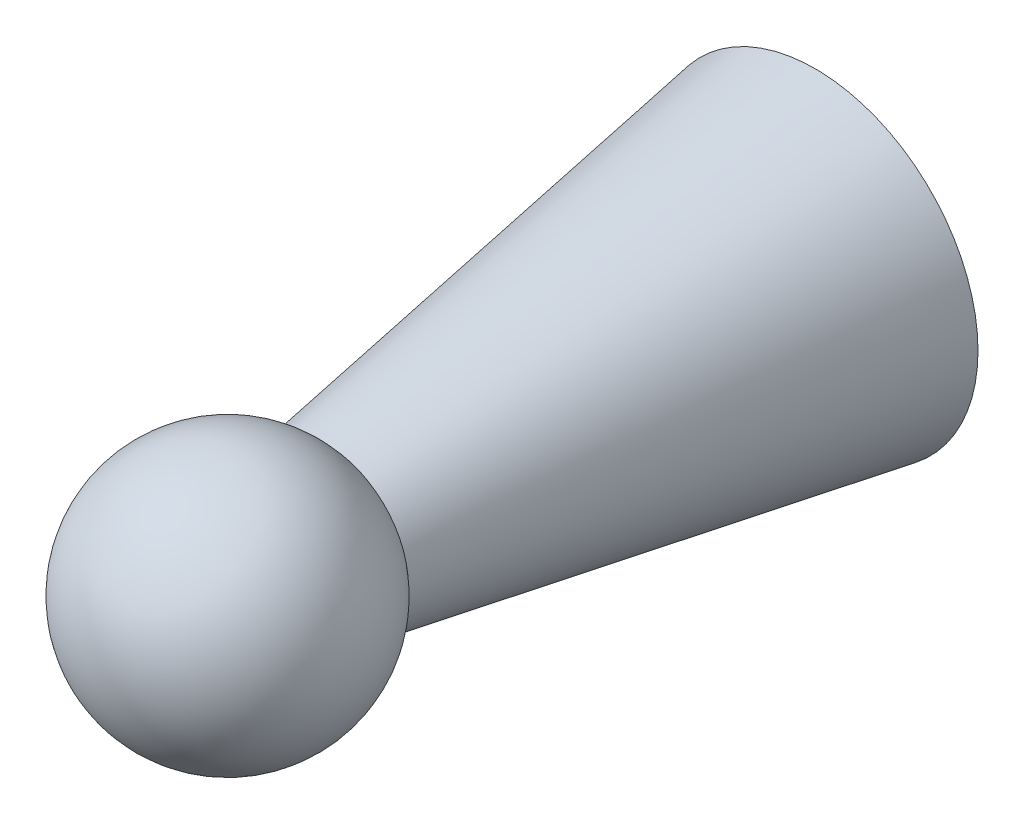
ISO-10303-21;
HEADER;
FILE_DESCRIPTION(('STEP AP214'),'2;1');
FILE_NAME('part.step','',(''),(''),'','','');
FILE_SCHEMA(('AUTOMOTIVE_DESIGN { 1 0 10303 214 1 1 1 1 }'));
ENDSEC;
DATA;
#1=APPLICATION_CONTEXT('core data for automotive mechanical design processes');
#2=APPLICATION_PROTOCOL_DEFINITION('international standard','automotive_design',2000,#1);
#3=PRODUCT_CONTEXT('',#1,'mechanical');
#4=PRODUCT('Part','Part','',(#3));
#5=PRODUCT_RELATED_PRODUCT_CATEGORY('part','',(#4));
#6=PRODUCT_DEFINITION_FORMATION('','',#4);
#7=PRODUCT_DEFINITION_CONTEXT('part definition',#1,'design');
#8=PRODUCT_DEFINITION('design','',#6,#7);
#9=PRODUCT_DEFINITION_SHAPE('','',#8);
#10=(LENGTH_UNIT() NAMED_UNIT(*) SI_UNIT(.MILLI.,.METRE.));
#11=(NAMED_UNIT(*) PLANE_ANGLE_UNIT() SI_UNIT($,.RADIAN.));
#12=(NAMED_UNIT(*) SI_UNIT($,.STERADIAN.) SOLID_ANGLE_UNIT());
#13=UNCERTAINTY_MEASURE_WITH_UNIT(LENGTH_MEASURE(1.E-05),#10,'distance_accuracy_value','');
#14=(GEOMETRIC_REPRESENTATION_CONTEXT(3) GLOBAL_UNCERTAINTY_ASSIGNED_CONTEXT((#13)) GLOBAL_UNIT_ASSIGNED_CONTEXT((#10,
#11,#12)) REPRESENTATION_CONTEXT('',''));
#15=CARTESIAN_POINT('',(0.,0.,0.));
#16=DIRECTION('',(0.,0.,1.));
#17=DIRECTION('',(1.,0.,0.));
#18=AXIS2_PLACEMENT_3D('',#15,#16,#17);
#19=CARTESIAN_POINT('',(0.,0.,0.));
#20=DIRECTION('',(0.,0.,1.));
#21=DIRECTION('',(1.,0.,0.));
#22=AXIS2_PLACEMENT_3D('',#19,#20,#21);
#23=PLANE('',#22);
#24=CARTESIAN_POINT('',(0.,0.,0.));
#25=DIRECTION('',(0.,0.,-1.));
#26=DIRECTION('',(-1.,0.,0.));
#27=AXIS2_PLACEMENT_3D('',#24,#25,#26);
#28=CIRCLE('',#27,2.5);
#29=CARTESIAN_POINT('',(-2.5,0.,0.));
#30=VERTEX_POINT('',#29);
#31=EDGE_CURVE('E54',#30,#30,#28,.T.);
#32=ORIENTED_EDGE('',*,*,#31,.F.);
#33=EDGE_LOOP('',(#32));
#34=FACE_BOUND('',#33,.T.);
#35=CARTESIAN_POINT('',(0.,0.,0.));
#36=DIRECTION('',(0.,0.,1.));
#37=DIRECTION('',(1.,0.,0.));
#38=AXIS2_PLACEMENT_3D('',#35,#36,#37);
#39=CIRCLE('',#38,5.);
#40=CARTESIAN_POINT('',(5.,0.,0.));
#41=VERTEX_POINT('',#40);
#42=EDGE_CURVE('E43',#41,#41,#39,.T.);
#43=ORIENTED_EDGE('',*,*,#42,.F.);
#44=EDGE_LOOP('',(#43));
#45=FACE_BOUND('',#44,.T.);
#46=ADVANCED_FACE('F32',(#34,#45),#23,.F.);
#47=CARTESIAN_POINT('',(0.,0.,18.0535714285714));
#48=DIRECTION('',(0.,0.,1.));
#49=DIRECTION('',(1.,0.,0.));
#50=AXIS2_PLACEMENT_3D('',#47,#48,#49);
#51=SPHERICAL_SURFACE('',#50,3.94642857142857);
#52=CARTESIAN_POINT('',(2.5,0.,15.));
#53=CARTESIAN_POINT('',(2.50000086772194,0.0409061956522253,15.));
#54=CARTESIAN_POINT('',(2.49899604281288,0.0818123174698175,15.));
#55=CARTESIAN_POINT('',(2.49498123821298,0.163526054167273,15.));
#56=CARTESIAN_POINT('',(2.49197125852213,0.204333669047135,15.));
#57=CARTESIAN_POINT('',(2.48395237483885,0.285752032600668,15.));
#58=CARTESIAN_POINT('',(2.47894347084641,0.326362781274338,15.));
#59=CARTESIAN_POINT('',(2.46693907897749,0.407289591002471,15.));
#60=CARTESIAN_POINT('',(2.45994359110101,0.447605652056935,15.));
#61=CARTESIAN_POINT('',(2.44398281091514,0.527845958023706,15.));
#62=CARTESIAN_POINT('',(2.43501751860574,0.567770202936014,15.));
#63=CARTESIAN_POINT('',(2.41513874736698,0.647130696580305,15.));
#64=CARTESIAN_POINT('',(2.40422526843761,0.68656694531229,15.));
#65=CARTESIAN_POINT('',(2.38047641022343,0.764856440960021,15.));
#66=CARTESIAN_POINT('',(2.36764103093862,0.803709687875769,15.));
#67=CARTESIAN_POINT('',(2.34007929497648,0.880739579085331,15.));
#68=CARTESIAN_POINT('',(2.32535293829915,0.918916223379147,15.));
#69=CARTESIAN_POINT('',(2.29404472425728,0.994500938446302,15.));
#70=CARTESIAN_POINT('',(2.27746286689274,1.03190900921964,15.));
#71=CARTESIAN_POINT('',(2.24248359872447,1.10586645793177,15.));
#72=CARTESIAN_POINT('',(2.22408618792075,1.14241583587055,15.));
#73=CARTESIAN_POINT('',(2.18552013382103,1.21456784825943,15.));
#74=CARTESIAN_POINT('',(2.16535149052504,1.25017048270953,15.));
#75=CARTESIAN_POINT('',(2.12329155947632,1.32034323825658,15.));
#76=CARTESIAN_POINT('',(2.1014002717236,1.35491335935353,15.));
#77=CARTESIAN_POINT('',(2.05594778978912,1.42293780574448,15.));
#78=CARTESIAN_POINT('',(2.03238659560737,1.45639213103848,15.));
#79=CARTESIAN_POINT('',(1.98365106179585,1.52210439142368,15.));
#80=CARTESIAN_POINT('',(1.95847672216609,1.55436232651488,15.));
#81=CARTESIAN_POINT('',(1.90657554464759,1.61760409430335,15.));
#82=CARTESIAN_POINT('',(1.87984870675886,1.64858792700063,15.));
#83=CARTESIAN_POINT('',(1.82490692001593,1.70920684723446,15.));
#84=CARTESIAN_POINT('',(1.79669197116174,1.738841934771,15.));
#85=CARTESIAN_POINT('',(1.738841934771,1.79669197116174,15.));
#86=CARTESIAN_POINT('',(1.70920684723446,1.82490692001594,15.));
#87=CARTESIAN_POINT('',(1.64858792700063,1.87984870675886,15.));
#88=CARTESIAN_POINT('',(1.61760409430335,1.90657554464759,15.));
#89=CARTESIAN_POINT('',(1.55436232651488,1.9584767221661,15.));
#90=CARTESIAN_POINT('',(1.52210439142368,1.98365106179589,15.));
#91=CARTESIAN_POINT('',(1.45639213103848,2.03238659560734,15.));
#92=CARTESIAN_POINT('',(1.42293780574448,2.05594778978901,15.));
#93=CARTESIAN_POINT('',(1.35491335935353,2.10140027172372,15.));
#94=CARTESIAN_POINT('',(1.3203432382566,2.12329155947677,15.));
#95=CARTESIAN_POINT('',(1.25017048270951,2.16535149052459,15.));
#96=CARTESIAN_POINT('',(1.21456784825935,2.18552013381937,15.));
#97=CARTESIAN_POINT('',(1.14241583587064,2.2240861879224,15.));
#98=CARTESIAN_POINT('',(1.10586645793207,2.24248359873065,15.));
#99=CARTESIAN_POINT('',(1.03190900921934,2.27746286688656,15.));
#100=CARTESIAN_POINT('',(0.994500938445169,2.29404472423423,15.));
#101=CARTESIAN_POINT('',(0.918916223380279,2.32535293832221,15.));
#102=CARTESIAN_POINT('',(0.880739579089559,2.34007929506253,15.));
#103=CARTESIAN_POINT('',(0.803709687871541,2.36764103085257,15.));
#104=CARTESIAN_POINT('',(0.764856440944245,2.38047640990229,15.));
#105=CARTESIAN_POINT('',(0.686566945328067,2.40422526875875,15.));
#106=CARTESIAN_POINT('',(0.647130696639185,2.41513874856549,15.));
#107=CARTESIAN_POINT('',(0.567770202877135,2.43501751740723,15.));
#108=CARTESIAN_POINT('',(0.527845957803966,2.44398280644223,15.));
#109=CARTESIAN_POINT('',(0.447605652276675,2.45994359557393,15.));
#110=CARTESIAN_POINT('',(0.407289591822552,2.46693909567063,15.));
#111=CARTESIAN_POINT('',(0.326362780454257,2.47894345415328,15.));
#112=CARTESIAN_POINT('',(0.285752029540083,2.48395231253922,15.));
#113=CARTESIAN_POINT('',(0.20433367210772,2.49197132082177,15.));
#114=CARTESIAN_POINT('',(0.16352606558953,2.49498147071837,15.));
#115=CARTESIAN_POINT('',(0.0818123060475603,2.49899581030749,15.));
#116=CARTESIAN_POINT('',(0.0409061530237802,2.5,15.));
#117=CARTESIAN_POINT('',(-0.0409061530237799,2.5,15.));
#118=CARTESIAN_POINT('',(-0.08181230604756,2.49899581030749,15.));
#119=CARTESIAN_POINT('',(-0.16352606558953,2.49498147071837,15.));
#120=CARTESIAN_POINT('',(-0.20433367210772,2.49197132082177,15.));
#121=CARTESIAN_POINT('',(-0.285752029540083,2.48395231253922,15.));
#122=CARTESIAN_POINT('',(-0.326362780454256,2.47894345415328,15.));
#123=CARTESIAN_POINT('',(-0.407289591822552,2.46693909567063,15.));
#124=CARTESIAN_POINT('',(-0.447605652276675,2.45994359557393,15.));
#125=CARTESIAN_POINT('',(-0.527845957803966,2.44398280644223,15.));
#126=CARTESIAN_POINT('',(-0.567770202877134,2.43501751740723,15.));
#127=CARTESIAN_POINT('',(-0.647130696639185,2.41513874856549,15.));
#128=CARTESIAN_POINT('',(-0.686566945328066,2.40422526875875,15.));
#129=CARTESIAN_POINT('',(-0.764856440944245,2.38047640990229,15.));
#130=CARTESIAN_POINT('',(-0.803709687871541,2.36764103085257,15.));
#131=CARTESIAN_POINT('',(-0.880739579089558,2.34007929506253,15.));
#132=CARTESIAN_POINT('',(-0.918916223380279,2.32535293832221,15.));
#133=CARTESIAN_POINT('',(-0.994500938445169,2.29404472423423,15.));
#134=CARTESIAN_POINT('',(-1.03190900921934,2.27746286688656,15.));
#135=CARTESIAN_POINT('',(-1.10586645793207,2.24248359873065,15.));
#136=CARTESIAN_POINT('',(-1.14241583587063,2.2240861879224,15.));
#137=CARTESIAN_POINT('',(-1.21456784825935,2.18552013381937,15.));
#138=CARTESIAN_POINT('',(-1.25017048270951,2.16535149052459,15.));
#139=CARTESIAN_POINT('',(-1.3203432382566,2.12329155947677,15.));
#140=CARTESIAN_POINT('',(-1.35491335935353,2.10140027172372,15.));
#141=CARTESIAN_POINT('',(-1.42293780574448,2.05594778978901,15.));
#142=CARTESIAN_POINT('',(-1.45639213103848,2.03238659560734,15.));
#143=CARTESIAN_POINT('',(-1.52210439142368,1.98365106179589,15.));
#144=CARTESIAN_POINT('',(-1.55436232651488,1.9584767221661,15.));
#145=CARTESIAN_POINT('',(-1.61760409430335,1.90657554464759,15.));
#146=CARTESIAN_POINT('',(-1.64858792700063,1.87984870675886,15.));
#147=CARTESIAN_POINT('',(-1.70920684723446,1.82490692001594,15.));
#148=CARTESIAN_POINT('',(-1.738841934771,1.79669197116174,15.));
#149=CARTESIAN_POINT('',(-1.79669197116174,1.738841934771,15.));
#150=CARTESIAN_POINT('',(-1.82490692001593,1.70920684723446,15.));
#151=CARTESIAN_POINT('',(-1.87984870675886,1.64858792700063,15.));
#152=CARTESIAN_POINT('',(-1.90657554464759,1.61760409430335,15.));
#153=CARTESIAN_POINT('',(-1.9584767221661,1.55436232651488,15.));
#154=CARTESIAN_POINT('',(-1.98365106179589,1.52210439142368,15.));
#155=CARTESIAN_POINT('',(-2.03238659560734,1.45639213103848,15.));
#156=CARTESIAN_POINT('',(-2.05594778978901,1.42293780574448,15.));
#157=CARTESIAN_POINT('',(-2.10140027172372,1.35491335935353,15.));
#158=CARTESIAN_POINT('',(-2.12329155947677,1.3203432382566,15.));
#159=CARTESIAN_POINT('',(-2.16535149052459,1.25017048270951,15.));
#160=CARTESIAN_POINT('',(-2.18552013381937,1.21456784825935,15.));
#161=CARTESIAN_POINT('',(-2.2240861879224,1.14241583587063,15.));
#162=CARTESIAN_POINT('',(-2.24248359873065,1.10586645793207,15.));
#163=CARTESIAN_POINT('',(-2.27746286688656,1.03190900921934,15.));
#164=CARTESIAN_POINT('',(-2.29404472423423,0.994500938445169,15.));
#165=CARTESIAN_POINT('',(-2.32535293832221,0.91891622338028,15.));
#166=CARTESIAN_POINT('',(-2.34007929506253,0.880739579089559,15.));
#167=CARTESIAN_POINT('',(-2.36764103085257,0.803709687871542,15.));
#168=CARTESIAN_POINT('',(-2.38047640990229,0.764856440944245,15.));
#169=CARTESIAN_POINT('',(-2.40422526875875,0.686566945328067,15.));
#170=CARTESIAN_POINT('',(-2.41513874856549,0.647130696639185,15.));
#171=CARTESIAN_POINT('',(-2.43501751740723,0.567770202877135,15.));
#172=CARTESIAN_POINT('',(-2.44398280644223,0.527845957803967,15.));
#173=CARTESIAN_POINT('',(-2.45994359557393,0.447605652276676,15.));
#174=CARTESIAN_POINT('',(-2.46693909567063,0.407289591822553,15.));
#175=CARTESIAN_POINT('',(-2.47894345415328,0.326362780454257,15.));
#176=CARTESIAN_POINT('',(-2.48395231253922,0.285752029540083,15.));
#177=CARTESIAN_POINT('',(-2.49197132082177,0.20433367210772,15.));
#178=CARTESIAN_POINT('',(-2.49498147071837,0.16352606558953,15.));
#179=CARTESIAN_POINT('',(-2.49899581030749,0.0818123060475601,15.));
#180=CARTESIAN_POINT('',(-2.5,0.0409061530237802,15.));
#181=CARTESIAN_POINT('',(-2.5,-0.0409061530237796,15.));
#182=CARTESIAN_POINT('',(-2.49899581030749,-0.0818123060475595,15.));
#183=CARTESIAN_POINT('',(-2.49498147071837,-0.163526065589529,15.));
#184=CARTESIAN_POINT('',(-2.49197132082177,-0.20433367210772,15.));
#185=CARTESIAN_POINT('',(-2.48395231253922,-0.285752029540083,15.));
#186=CARTESIAN_POINT('',(-2.47894345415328,-0.326362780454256,15.));
#187=CARTESIAN_POINT('',(-2.46693909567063,-0.407289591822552,15.));
#188=CARTESIAN_POINT('',(-2.45994359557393,-0.447605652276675,15.));
#189=CARTESIAN_POINT('',(-2.44398280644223,-0.527845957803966,15.));
#190=CARTESIAN_POINT('',(-2.43501751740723,-0.567770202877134,15.));
#191=CARTESIAN_POINT('',(-2.41513874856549,-0.647130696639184,15.));
#192=CARTESIAN_POINT('',(-2.40422526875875,-0.686566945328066,15.));
#193=CARTESIAN_POINT('',(-2.38047640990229,-0.764856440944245,15.));
#194=CARTESIAN_POINT('',(-2.36764103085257,-0.803709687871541,15.));
#195=CARTESIAN_POINT('',(-2.34007929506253,-0.880739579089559,15.));
#196=CARTESIAN_POINT('',(-2.32535293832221,-0.918916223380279,15.));
#197=CARTESIAN_POINT('',(-2.29404472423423,-0.994500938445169,15.));
#198=CARTESIAN_POINT('',(-2.27746286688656,-1.03190900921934,15.));
#199=CARTESIAN_POINT('',(-2.24248359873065,-1.10586645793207,15.));
#200=CARTESIAN_POINT('',(-2.2240861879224,-1.14241583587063,15.));
#201=CARTESIAN_POINT('',(-2.18552013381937,-1.21456784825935,15.));
#202=CARTESIAN_POINT('',(-2.16535149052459,-1.25017048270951,15.));
#203=CARTESIAN_POINT('',(-2.12329155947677,-1.3203432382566,15.));
#204=CARTESIAN_POINT('',(-2.10140027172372,-1.35491335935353,15.));
#205=CARTESIAN_POINT('',(-2.05594778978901,-1.42293780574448,15.));
#206=CARTESIAN_POINT('',(-2.03238659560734,-1.45639213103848,15.));
#207=CARTESIAN_POINT('',(-1.98365106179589,-1.52210439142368,15.));
#208=CARTESIAN_POINT('',(-1.9584767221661,-1.55436232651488,15.));
#209=CARTESIAN_POINT('',(-1.90657554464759,-1.61760409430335,15.));
#210=CARTESIAN_POINT('',(-1.87984870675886,-1.64858792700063,15.));
#211=CARTESIAN_POINT('',(-1.82490692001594,-1.70920684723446,15.));
#212=CARTESIAN_POINT('',(-1.79669197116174,-1.738841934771,15.));
#213=CARTESIAN_POINT('',(-1.738841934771,-1.79669197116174,15.));
#214=CARTESIAN_POINT('',(-1.70920684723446,-1.82490692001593,15.));
#215=CARTESIAN_POINT('',(-1.64858792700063,-1.87984870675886,15.));
#216=CARTESIAN_POINT('',(-1.61760409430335,-1.90657554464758,15.));
#217=CARTESIAN_POINT('',(-1.55436232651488,-1.9584767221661,15.));
#218=CARTESIAN_POINT('',(-1.52210439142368,-1.98365106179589,15.));
#219=CARTESIAN_POINT('',(-1.45639213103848,-2.03238659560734,15.));
#220=CARTESIAN_POINT('',(-1.42293780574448,-2.05594778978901,15.));
#221=CARTESIAN_POINT('',(-1.35491335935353,-2.10140027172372,15.));
#222=CARTESIAN_POINT('',(-1.3203432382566,-2.12329155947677,15.));
#223=CARTESIAN_POINT('',(-1.25017048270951,-2.16535149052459,15.));
#224=CARTESIAN_POINT('',(-1.21456784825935,-2.18552013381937,15.));
#225=CARTESIAN_POINT('',(-1.14241583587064,-2.2240861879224,15.));
#226=CARTESIAN_POINT('',(-1.10586645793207,-2.24248359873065,15.));
#227=CARTESIAN_POINT('',(-1.03190900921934,-2.27746286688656,15.));
#228=CARTESIAN_POINT('',(-0.994500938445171,-2.29404472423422,15.));
#229=CARTESIAN_POINT('',(-0.91891622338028,-2.32535293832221,15.));
#230=CARTESIAN_POINT('',(-0.880739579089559,-2.34007929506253,15.));
#231=CARTESIAN_POINT('',(-0.803709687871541,-2.36764103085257,15.));
#232=CARTESIAN_POINT('',(-0.764856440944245,-2.38047640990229,15.));
#233=CARTESIAN_POINT('',(-0.686566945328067,-2.40422526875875,15.));
#234=CARTESIAN_POINT('',(-0.647130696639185,-2.41513874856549,15.));
#235=CARTESIAN_POINT('',(-0.567770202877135,-2.43501751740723,15.));
#236=CARTESIAN_POINT('',(-0.527845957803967,-2.44398280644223,15.));
#237=CARTESIAN_POINT('',(-0.447605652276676,-2.45994359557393,15.));
#238=CARTESIAN_POINT('',(-0.407289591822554,-2.46693909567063,15.));
#239=CARTESIAN_POINT('',(-0.326362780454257,-2.47894345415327,15.));
#240=CARTESIAN_POINT('',(-0.285752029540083,-2.48395231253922,15.));
#241=CARTESIAN_POINT('',(-0.20433367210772,-2.49197132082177,15.));
#242=CARTESIAN_POINT('',(-0.16352606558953,-2.49498147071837,15.));
#243=CARTESIAN_POINT('',(-0.0818123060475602,-2.49899581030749,15.));
#244=CARTESIAN_POINT('',(-0.0409061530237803,-2.5,15.));
#245=CARTESIAN_POINT('',(0.0409061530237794,-2.5,15.));
#246=CARTESIAN_POINT('',(0.0818123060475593,-2.49899581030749,15.));
#247=CARTESIAN_POINT('',(0.163526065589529,-2.49498147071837,15.));
#248=CARTESIAN_POINT('',(0.204333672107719,-2.49197132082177,15.));
#249=CARTESIAN_POINT('',(0.285752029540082,-2.48395231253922,15.));
#250=CARTESIAN_POINT('',(0.326362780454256,-2.47894345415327,15.));
#251=CARTESIAN_POINT('',(0.407289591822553,-2.46693909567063,15.));
#252=CARTESIAN_POINT('',(0.447605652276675,-2.45994359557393,15.));
#253=CARTESIAN_POINT('',(0.527845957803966,-2.44398280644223,15.));
#254=CARTESIAN_POINT('',(0.567770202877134,-2.43501751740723,15.));
#255=CARTESIAN_POINT('',(0.647130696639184,-2.41513874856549,15.));
#256=CARTESIAN_POINT('',(0.686566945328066,-2.40422526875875,15.));
#257=CARTESIAN_POINT('',(0.764856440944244,-2.38047640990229,15.));
#258=CARTESIAN_POINT('',(0.80370968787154,-2.36764103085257,15.));
#259=CARTESIAN_POINT('',(0.880739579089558,-2.34007929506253,15.));
#260=CARTESIAN_POINT('',(0.918916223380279,-2.32535293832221,15.));
#261=CARTESIAN_POINT('',(0.99450093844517,-2.29404472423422,15.));
#262=CARTESIAN_POINT('',(1.03190900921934,-2.27746286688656,15.));
#263=CARTESIAN_POINT('',(1.10586645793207,-2.24248359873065,15.));
#264=CARTESIAN_POINT('',(1.14241583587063,-2.2240861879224,15.));
#265=CARTESIAN_POINT('',(1.21456784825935,-2.18552013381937,15.));
#266=CARTESIAN_POINT('',(1.25017048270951,-2.16535149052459,15.));
#267=CARTESIAN_POINT('',(1.3203432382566,-2.12329155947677,15.));
#268=CARTESIAN_POINT('',(1.35491335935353,-2.10140027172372,15.));
#269=CARTESIAN_POINT('',(1.42293780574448,-2.05594778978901,15.));
#270=CARTESIAN_POINT('',(1.45639213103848,-2.03238659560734,15.));
#271=CARTESIAN_POINT('',(1.52210439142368,-1.98365106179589,15.));
#272=CARTESIAN_POINT('',(1.55436232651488,-1.9584767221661,15.));
#273=CARTESIAN_POINT('',(1.61760409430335,-1.90657554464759,15.));
#274=CARTESIAN_POINT('',(1.64858792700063,-1.87984870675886,15.));
#275=CARTESIAN_POINT('',(1.70920684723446,-1.82490692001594,15.));
#276=CARTESIAN_POINT('',(1.738841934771,-1.79669197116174,15.));
#277=CARTESIAN_POINT('',(1.79669197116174,-1.738841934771,15.));
#278=CARTESIAN_POINT('',(1.82490692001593,-1.70920684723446,15.));
#279=CARTESIAN_POINT('',(1.87984870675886,-1.64858792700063,15.));
#280=CARTESIAN_POINT('',(1.90657554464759,-1.61760409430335,15.));
#281=CARTESIAN_POINT('',(1.95847672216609,-1.55436232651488,15.));
#282=CARTESIAN_POINT('',(1.98365106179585,-1.52210439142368,15.));
#283=CARTESIAN_POINT('',(2.03238659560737,-1.45639213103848,15.));
#284=CARTESIAN_POINT('',(2.05594778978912,-1.42293780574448,15.));
#285=CARTESIAN_POINT('',(2.1014002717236,-1.35491335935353,15.));
#286=CARTESIAN_POINT('',(2.12329155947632,-1.32034323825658,15.));
#287=CARTESIAN_POINT('',(2.16535149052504,-1.25017048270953,15.));
#288=CARTESIAN_POINT('',(2.18552013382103,-1.21456784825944,15.));
#289=CARTESIAN_POINT('',(2.22408618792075,-1.14241583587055,15.));
#290=CARTESIAN_POINT('',(2.24248359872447,-1.10586645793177,15.));
#291=CARTESIAN_POINT('',(2.27746286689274,-1.03190900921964,15.));
#292=CARTESIAN_POINT('',(2.29404472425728,-0.994500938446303,15.));
#293=CARTESIAN_POINT('',(2.32535293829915,-0.918916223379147,15.));
#294=CARTESIAN_POINT('',(2.34007929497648,-0.880739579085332,15.));
#295=CARTESIAN_POINT('',(2.36764103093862,-0.803709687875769,15.));
#296=CARTESIAN_POINT('',(2.38047641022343,-0.764856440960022,15.));
#297=CARTESIAN_POINT('',(2.40422526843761,-0.68656694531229,15.));
#298=CARTESIAN_POINT('',(2.41513874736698,-0.647130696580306,15.));
#299=CARTESIAN_POINT('',(2.43501751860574,-0.567770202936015,15.));
#300=CARTESIAN_POINT('',(2.44398281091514,-0.527845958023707,15.));
#301=CARTESIAN_POINT('',(2.45994359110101,-0.447605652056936,15.));
#302=CARTESIAN_POINT('',(2.46693907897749,-0.407289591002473,15.));
#303=CARTESIAN_POINT('',(2.47894347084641,-0.326362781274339,15.));
#304=CARTESIAN_POINT('',(2.48395237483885,-0.285752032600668,15.));
#305=CARTESIAN_POINT('',(2.49197125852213,-0.204333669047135,15.));
#306=CARTESIAN_POINT('',(2.49498123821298,-0.163526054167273,15.));
#307=CARTESIAN_POINT('',(2.49899604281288,-0.0818123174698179,15.));
#308=CARTESIAN_POINT('',(2.50000086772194,-0.0409061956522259,15.));
#309=CARTESIAN_POINT('',(2.5,0.,15.));
#310=B_SPLINE_CURVE_WITH_KNOTS('',3,(#52,#53,#54,#55,#56,#57,#58,#59,#60,#61,#62,#63,#64,#65,
#66,#67,#68,#69,#70,#71,#72,#73,#74,#75,#76,#77,#78,#79,#80,#81,#82,#83,#84,#85,#86,#87,#88,#89,
#90,#91,#92,#93,#94,#95,#96,#97,#98,#99,#100,#101,#102,#103,#104,#105,#106,#107,#108,#109,#110,
#111,#112,#113,#114,#115,#116,#117,#118,#119,#120,#121,#122,#123,#124,#125,#126,#127,#128,#129,
#130,#131,#132,#133,#134,#135,#136,#137,#138,#139,#140,#141,#142,#143,#144,#145,#146,#147,#148,
#149,#150,#151,#152,#153,#154,#155,#156,#157,#158,#159,#160,#161,#162,#163,#164,#165,#166,#167,
#168,#169,#170,#171,#172,#173,#174,#175,#176,#177,#178,#179,#180,#181,#182,#183,#184,#185,#186,
#187,#188,#189,#190,#191,#192,#193,#194,#195,#196,#197,#198,#199,#200,#201,#202,#203,#204,#205,
#206,#207,#208,#209,#210,#211,#212,#213,#214,#215,#216,#217,#218,#219,#220,#221,#222,#223,#224,
#225,#226,#227,#228,#229,#230,#231,#232,#233,#234,#235,#236,#237,#238,#239,#240,#241,#242,#243,
#244,#245,#246,#247,#248,#249,#250,#251,#252,#253,#254,#255,#256,#257,#258,#259,#260,#261,#262,
#263,#264,#265,#266,#267,#268,#269,#270,#271,#272,#273,#274,#275,#276,#277,#278,#279,#280,#281,
#282,#283,#284,#285,#286,#287,#288,#289,#290,#291,#292,#293,#294,#295,#296,#297,#298,#299,#300,
#301,#302,#303,#304,#305,#306,#307,#308,#309),.UNSPECIFIED.,.F.,.F.,(4,2,2,2,2,2,2,2,2,2,2,2,2,
2,2,2,2,2,2,2,2,2,2,2,2,2,2,2,2,2,2,2,2,2,2,2,2,2,2,2,2,2,2,2,2,2,2,2,2,2,2,2,2,2,2,2,2,2,2,2,2,
2,2,2,2,2,2,2,2,2,2,2,2,2,2,2,2,2,2,2,2,2,2,2,2,2,2,2,2,2,2,2,2,2,2,2,2,2,2,2,2,2,2,2,2,2,2,2,2,
2,2,2,2,2,2,2,2,2,2,2,2,2,2,2,2,2,2,2,4),(0.,0.122706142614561,0.245412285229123,
0.368118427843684,0.490824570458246,0.613530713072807,0.736236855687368,0.85894299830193,
0.981649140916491,1.10435528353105,1.22706142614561,1.34976756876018,1.47247371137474,
1.5951798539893,1.71788599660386,1.84059213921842,1.96329828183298,2.08600442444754,
2.20871056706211,2.33141670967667,2.45412285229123,2.57682899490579,2.69953513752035,
2.82224128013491,2.94494742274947,3.06765356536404,3.1903597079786,3.31306585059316,
3.43577199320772,3.55847813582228,3.68118427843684,3.8038904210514,3.92659656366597,
4.04930270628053,4.17200884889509,4.29471499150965,4.41742113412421,4.54012727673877,
4.66283341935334,4.7855395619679,4.90824570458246,5.03095184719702,5.15365798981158,
5.27636413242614,5.3990702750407,5.52177641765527,5.64448256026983,5.76718870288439,
5.88989484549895,6.01260098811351,6.13530713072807,6.25801327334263,6.3807194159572,
6.50342555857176,6.62613170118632,6.74883784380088,6.87154398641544,6.99425012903,
7.11695627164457,7.23966241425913,7.36236855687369,7.48507469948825,7.60778084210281,
7.73048698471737,7.85319312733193,7.97589926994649,8.09860541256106,8.22131155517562,
8.34401769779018,8.46672384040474,8.5894299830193,8.71213612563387,8.83484226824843,
8.95754841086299,9.08025455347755,9.20296069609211,9.32566683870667,9.44837298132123,
9.5710791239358,9.69378526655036,9.81649140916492,9.93919755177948,10.061903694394,
10.1846098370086,10.3073159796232,10.4300221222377,10.5527282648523,10.6754344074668,
10.7981405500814,10.920846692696,11.0435528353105,11.1662589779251,11.2889651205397,
11.4116712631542,11.5343774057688,11.6570835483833,11.7797896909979,11.9024958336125,
12.025201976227,12.1479081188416,12.2706142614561,12.3933204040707,12.5160265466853,
12.6387326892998,12.7614388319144,12.884144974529,13.0068511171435,13.1295572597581,
13.2522634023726,13.3749695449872,13.4976756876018,13.6203818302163,13.7430879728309,
13.8657941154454,13.98850025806,14.1112064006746,14.2339125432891,14.3566186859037,
14.4793248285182,14.6020309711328,14.7247371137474,14.8474432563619,14.9701493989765,
15.0928555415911,15.2155616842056,15.3382678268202,15.4609739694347,15.5836801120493,
15.7063862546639),.UNSPECIFIED.);
#311=CARTESIAN_POINT('',(2.5,0.,15.));
#312=VERTEX_POINT('',#311);
#313=EDGE_CURVE('E11',#312,#312,#310,.T.);
#314=ORIENTED_EDGE('',*,*,#313,.T.);
#315=EDGE_LOOP('',(#314));
#316=FACE_BOUND('',#315,.T.);
#317=ADVANCED_FACE('F34',(#316),#51,.T.);
#318=CARTESIAN_POINT('',(0.,0.,15.));
#319=DIRECTION('',(0.,0.,-1.));
#320=DIRECTION('',(-1.,0.,0.));
#321=AXIS2_PLACEMENT_3D('',#318,#319,#320);
#322=CONICAL_SURFACE('',#321,2.5,0.165148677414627);
#323=ORIENTED_EDGE('',*,*,#313,.F.);
#324=EDGE_LOOP('',(#323));
#325=FACE_BOUND('',#324,.T.);
#326=ORIENTED_EDGE('',*,*,#42,.T.);
#327=EDGE_LOOP('',(#326));
#328=FACE_BOUND('',#327,.T.);
#329=ADVANCED_FACE('F71',(#325,#328),#322,.T.);
#330=CARTESIAN_POINT('',(0.,0.,8.));
#331=DIRECTION('',(0.,0.,-1.));
#332=DIRECTION('',(-1.,0.,0.));
#333=AXIS2_PLACEMENT_3D('',#330,#331,#332);
#334=CYLINDRICAL_SURFACE('',#333,2.5);
#335=CARTESIAN_POINT('',(0.,0.,8.));
#336=DIRECTION('',(0.,0.,-1.));
#337=DIRECTION('',(-1.,0.,0.));
#338=AXIS2_PLACEMENT_3D('',#335,#336,#337);
#339=CIRCLE('',#338,2.5);
#340=CARTESIAN_POINT('',(-2.5,0.,8.));
#341=VERTEX_POINT('',#340);
#342=EDGE_CURVE('E48',#341,#341,#339,.T.);
#343=ORIENTED_EDGE('',*,*,#342,.F.);
#344=EDGE_LOOP('',(#343));
#345=FACE_BOUND('',#344,.T.);
#346=ORIENTED_EDGE('',*,*,#31,.T.);
#347=EDGE_LOOP('',(#346));
#348=FACE_BOUND('',#347,.T.);
#349=ADVANCED_FACE('F73',(#345,#348),#334,.F.);
#350=CARTESIAN_POINT('',(0.,0.,8.));
#351=DIRECTION('',(0.,0.,-1.));
#352=DIRECTION('',(-1.,0.,0.));
#353=AXIS2_PLACEMENT_3D('',#350,#351,#352);
#354=PLANE('',#353);
#355=ORIENTED_EDGE('',*,*,#342,.T.);
#356=EDGE_LOOP('',(#355));
#357=FACE_BOUND('',#356,.T.);
#358=ADVANCED_FACE('F78',(#357),#354,.T.);
#359=CLOSED_SHELL('',(#46,#317,#329,#349,#358));
#360=MANIFOLD_SOLID_BREP('B2',#359);
#361=ADVANCED_BREP_SHAPE_REPRESENTATION('',(#18,#360),#14);
#362=SHAPE_DEFINITION_REPRESENTATION(#9,#361);
ENDSEC;
END-ISO-10303-21;
